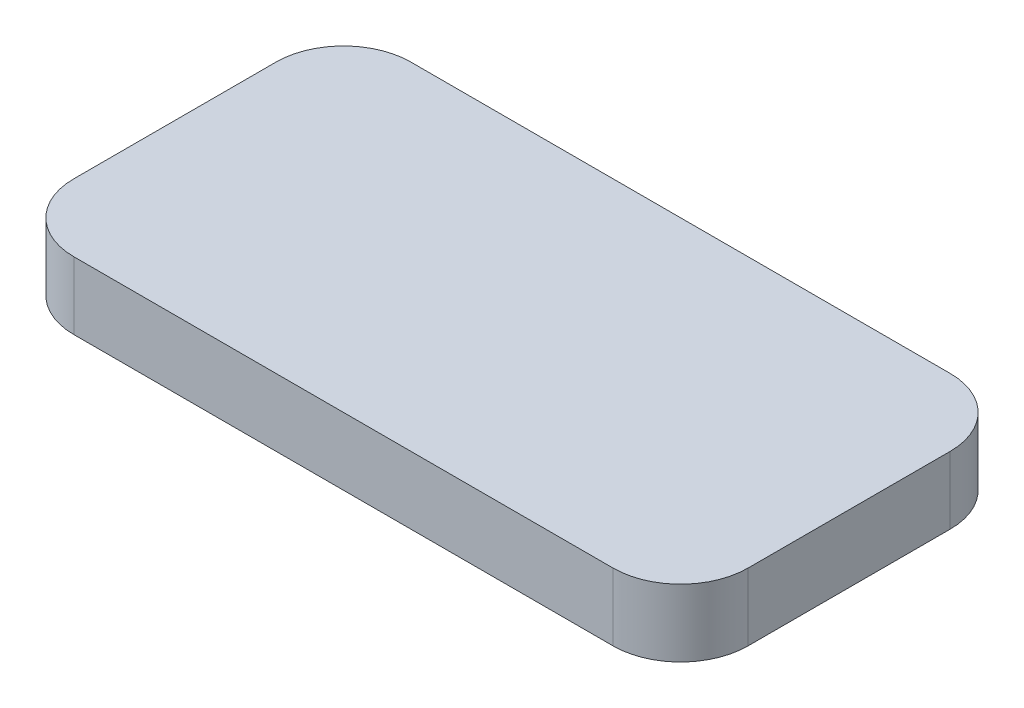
from build123d import *

# Parameters (mm, degrees)
EXTRUDE1_DEPTH = 20


with BuildPart() as part:
    # Sketch1 → Extrude1 (new body)
    with BuildSketch(Plane(origin=(0, 0, 0), x_dir=(1, 0, 0), z_dir=(0, 1, 0))):
        with BuildLine():
            Line((20, 0), (180, 0))
            ThreePointArc((180, 0), (194.142135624, 5.857864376), (200, 20))
            Line((200, 20), (200, 80))
            ThreePointArc((200, 80), (194.142135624, 94.142135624), (180, 100))
            Line((180, 100), (20, 100))
            ThreePointArc((20, 100), (5.857864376, 94.142135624), (0, 80))
            Line((0, 80), (0, 20))
            ThreePointArc((0, 20), (5.857864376, 5.857864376), (20, 0))
        make_face()
    extrude(amount=EXTRUDE1_DEPTH)


solid = part.part
